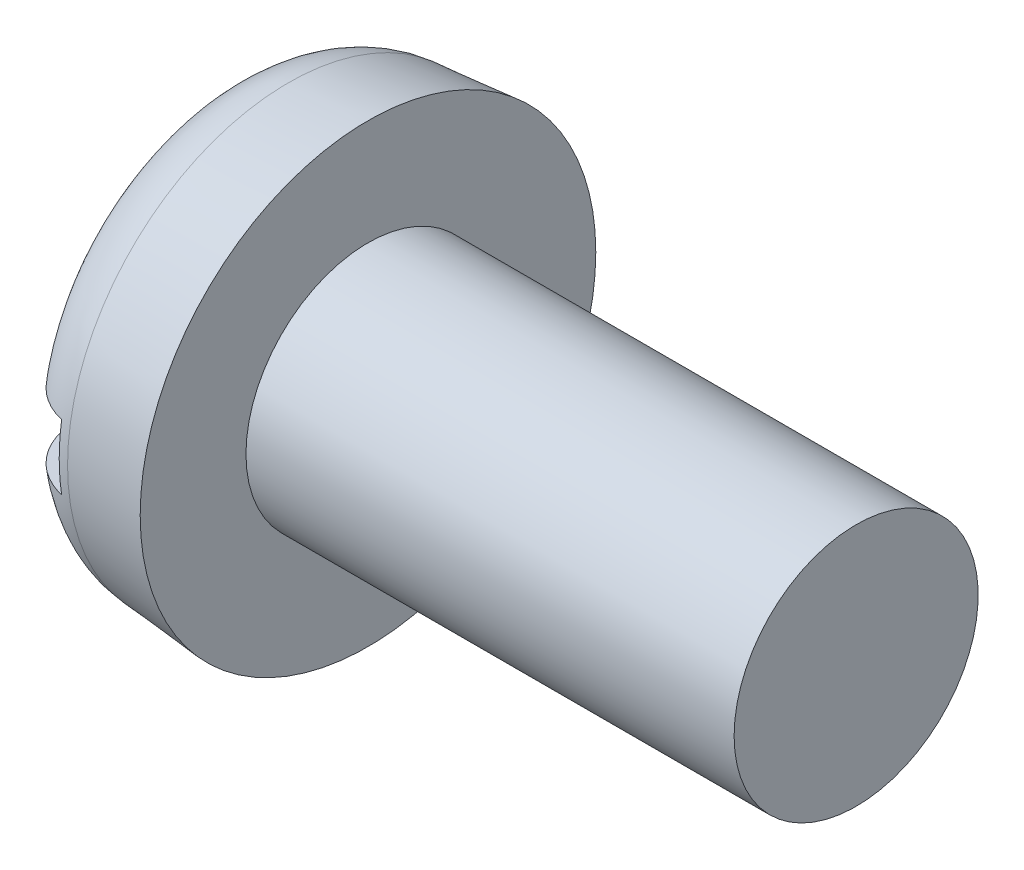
ISO-10303-21;
HEADER;
FILE_DESCRIPTION(('STEP AP214'),'2;1');
FILE_NAME('part.step','',(''),(''),'','','');
FILE_SCHEMA(('AUTOMOTIVE_DESIGN { 1 0 10303 214 1 1 1 1 }'));
ENDSEC;
DATA;
#1=APPLICATION_CONTEXT('core data for automotive mechanical design processes');
#2=APPLICATION_PROTOCOL_DEFINITION('international standard','automotive_design',2000,#1);
#3=PRODUCT_CONTEXT('',#1,'mechanical');
#4=PRODUCT('Part','Part','',(#3));
#5=PRODUCT_RELATED_PRODUCT_CATEGORY('part','',(#4));
#6=PRODUCT_DEFINITION_FORMATION('','',#4);
#7=PRODUCT_DEFINITION_CONTEXT('part definition',#1,'design');
#8=PRODUCT_DEFINITION('design','',#6,#7);
#9=PRODUCT_DEFINITION_SHAPE('','',#8);
#10=(LENGTH_UNIT() NAMED_UNIT(*) SI_UNIT(.MILLI.,.METRE.));
#11=(NAMED_UNIT(*) PLANE_ANGLE_UNIT() SI_UNIT($,.RADIAN.));
#12=(NAMED_UNIT(*) SI_UNIT($,.STERADIAN.) SOLID_ANGLE_UNIT());
#13=UNCERTAINTY_MEASURE_WITH_UNIT(LENGTH_MEASURE(1.E-05),#10,'distance_accuracy_value','');
#14=(GEOMETRIC_REPRESENTATION_CONTEXT(3) GLOBAL_UNCERTAINTY_ASSIGNED_CONTEXT((#13)) GLOBAL_UNIT_ASSIGNED_CONTEXT((#10,
#11,#12)) REPRESENTATION_CONTEXT('',''));
#15=CARTESIAN_POINT('',(0.,0.,0.));
#16=DIRECTION('',(0.,0.,1.));
#17=DIRECTION('',(1.,0.,0.));
#18=AXIS2_PLACEMENT_3D('',#15,#16,#17);
#19=CARTESIAN_POINT('',(0.,0.,0.));
#20=DIRECTION('',(-1.,0.,0.));
#21=DIRECTION('',(0.,0.,1.));
#22=AXIS2_PLACEMENT_3D('',#19,#20,#21);
#23=PLANE('',#22);
#24=DIRECTION('',(0.,0.,-1.));
#25=VECTOR('',#24,1.);
#26=CARTESIAN_POINT('',(0.,0.399999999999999,2.8));
#27=LINE('',#26,#25);
#28=CARTESIAN_POINT('',(0.,0.399999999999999,1.77326763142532));
#29=VERTEX_POINT('',#28);
#30=CARTESIAN_POINT('',(0.,0.399999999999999,-1.77326763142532));
#31=VERTEX_POINT('',#30);
#32=EDGE_CURVE('E85',#29,#31,#27,.T.);
#33=ORIENTED_EDGE('',*,*,#32,.F.);
#34=CARTESIAN_POINT('',(0.,0.,0.));
#35=DIRECTION('',(-1.,0.,0.));
#36=DIRECTION('',(0.,0.,1.));
#37=AXIS2_PLACEMENT_3D('',#34,#35,#36);
#38=CIRCLE('',#37,1.81782234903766);
#39=EDGE_CURVE('E91',#29,#31,#38,.T.);
#40=ORIENTED_EDGE('',*,*,#39,.T.);
#41=EDGE_LOOP('',(#33,#40));
#42=FACE_BOUND('',#41,.T.);
#43=ADVANCED_FACE('F32',(#42),#23,.T.);
#44=CARTESIAN_POINT('',(-25.4,0.,0.));
#45=DIRECTION('',(-1.,0.,0.));
#46=DIRECTION('',(0.,0.,1.));
#47=AXIS2_PLACEMENT_3D('',#44,#45,#46);
#48=CYLINDRICAL_SURFACE('',#47,1.5);
#49=CARTESIAN_POINT('',(7.8,0.,0.));
#50=DIRECTION('',(-1.,0.,0.));
#51=DIRECTION('',(0.,0.,1.));
#52=AXIS2_PLACEMENT_3D('',#49,#50,#51);
#53=CIRCLE('',#52,1.5);
#54=CARTESIAN_POINT('',(7.8,0.,1.5));
#55=VERTEX_POINT('',#54);
#56=EDGE_CURVE('E92',#55,#55,#53,.T.);
#57=ORIENTED_EDGE('',*,*,#56,.T.);
#58=EDGE_LOOP('',(#57));
#59=FACE_BOUND('',#58,.T.);
#60=CARTESIAN_POINT('',(1.8,0.,0.));
#61=DIRECTION('',(-1.,0.,0.));
#62=DIRECTION('',(0.,0.,1.));
#63=AXIS2_PLACEMENT_3D('',#60,#61,#62);
#64=CIRCLE('',#63,1.5);
#65=CARTESIAN_POINT('',(1.8,0.,1.5));
#66=VERTEX_POINT('',#65);
#67=EDGE_CURVE('E149',#66,#66,#64,.T.);
#68=ORIENTED_EDGE('',*,*,#67,.F.);
#69=EDGE_LOOP('',(#68));
#70=FACE_BOUND('',#69,.T.);
#71=ADVANCED_FACE('F137',(#59,#70),#48,.T.);
#72=CARTESIAN_POINT('',(7.8,1.5,0.));
#73=DIRECTION('',(1.,0.,0.));
#74=DIRECTION('',(0.,0.,-1.));
#75=AXIS2_PLACEMENT_3D('',#72,#73,#74);
#76=PLANE('',#75);
#77=ORIENTED_EDGE('',*,*,#56,.F.);
#78=EDGE_LOOP('',(#77));
#79=FACE_BOUND('',#78,.T.);
#80=ADVANCED_FACE('F135',(#79),#76,.T.);
#81=DIRECTION('',(0.,0.,1.));
#82=VECTOR('',#81,1.);
#83=CARTESIAN_POINT('',(0.,-0.4,-2.8));
#84=LINE('',#83,#82);
#85=CARTESIAN_POINT('',(0.,-0.4,-1.77326763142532));
#86=VERTEX_POINT('',#85);
#87=CARTESIAN_POINT('',(0.,-0.4,1.77326763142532));
#88=VERTEX_POINT('',#87);
#89=EDGE_CURVE('E76',#86,#88,#84,.T.);
#90=ORIENTED_EDGE('',*,*,#89,.F.);
#91=EDGE_CURVE('E83',#86,#88,#38,.T.);
#92=ORIENTED_EDGE('',*,*,#91,.T.);
#93=EDGE_LOOP('',(#90,#92));
#94=FACE_BOUND('',#93,.T.);
#95=ADVANCED_FACE('F82',(#94),#23,.T.);
#96=CARTESIAN_POINT('',(0.,0.,0.));
#97=DIRECTION('',(1.,0.,0.));
#98=DIRECTION('',(0.,0.,-1.));
#99=AXIS2_PLACEMENT_3D('',#96,#97,#98);
#100=CONICAL_SURFACE('',#99,2.64252040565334,0.087266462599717);
#101=CARTESIAN_POINT('',(0.821559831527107,0.,0.));
#102=DIRECTION('',(-1.,0.,0.));
#103=DIRECTION('',(0.,0.,1.));
#104=AXIS2_PLACEMENT_3D('',#101,#102,#103);
#105=CIRCLE('',#104,2.71439757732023);
#106=CARTESIAN_POINT('',(0.821559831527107,0.,2.71439757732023));
#107=VERTEX_POINT('',#106);
#108=EDGE_CURVE('E95',#107,#107,#105,.F.);
#109=ORIENTED_EDGE('',*,*,#108,.T.);
#110=EDGE_LOOP('',(#109));
#111=FACE_BOUND('',#110,.T.);
#112=CARTESIAN_POINT('',(1.8,0.,0.));
#113=DIRECTION('',(-1.,0.,0.));
#114=DIRECTION('',(0.,0.,1.));
#115=AXIS2_PLACEMENT_3D('',#112,#113,#114);
#116=CIRCLE('',#115,2.8);
#117=CARTESIAN_POINT('',(1.8,0.,2.8));
#118=VERTEX_POINT('',#117);
#119=EDGE_CURVE('E97',#118,#118,#116,.T.);
#120=ORIENTED_EDGE('',*,*,#119,.T.);
#121=EDGE_LOOP('',(#120));
#122=FACE_BOUND('',#121,.T.);
#123=ADVANCED_FACE('F128',(#111,#122),#100,.T.);
#124=CARTESIAN_POINT('',(1.8,1.5,0.));
#125=DIRECTION('',(-1.,0.,0.));
#126=DIRECTION('',(0.,0.,1.));
#127=AXIS2_PLACEMENT_3D('',#124,#125,#126);
#128=PLANE('',#127);
#129=ORIENTED_EDGE('',*,*,#119,.F.);
#130=EDGE_LOOP('',(#129));
#131=FACE_BOUND('',#130,.T.);
#132=ORIENTED_EDGE('',*,*,#67,.T.);
#133=EDGE_LOOP('',(#132));
#134=FACE_BOUND('',#133,.T.);
#135=ADVANCED_FACE('F124',(#131,#134),#128,.F.);
#136=CARTESIAN_POINT('',(0.9,0.,0.));
#137=DIRECTION('',(-1.,0.,0.));
#138=DIRECTION('',(0.,0.,1.));
#139=AXIS2_PLACEMENT_3D('',#136,#137,#138);
#140=TOROIDAL_SURFACE('',#139,1.81782234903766,0.9);
#141=CARTESIAN_POINT('',(0.285780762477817,0.399999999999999,-2.44311963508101));
#142=CARTESIAN_POINT('',(0.322325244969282,0.399999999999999,-2.47769297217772));
#143=CARTESIAN_POINT('',(0.361794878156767,0.399999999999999,-2.50922544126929));
#144=CARTESIAN_POINT('',(0.445493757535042,0.399999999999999,-2.56525291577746));
#145=CARTESIAN_POINT('',(0.48972822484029,0.399999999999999,-2.58974009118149));
#146=CARTESIAN_POINT('',(0.581685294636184,0.399999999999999,-2.63091846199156));
#147=CARTESIAN_POINT('',(0.629407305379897,0.399999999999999,-2.64761097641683));
#148=CARTESIAN_POINT('',(0.726972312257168,0.399999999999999,-2.67270033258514));
#149=CARTESIAN_POINT('',(0.776814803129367,0.399999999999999,-2.68109913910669));
#150=CARTESIAN_POINT('',(0.876977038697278,0.399999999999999,-2.68933922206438));
#151=CARTESIAN_POINT('',(0.92729364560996,0.399999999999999,-2.68921866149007));
#152=CARTESIAN_POINT('',(1.02719093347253,0.399999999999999,-2.68051830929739));
#153=CARTESIAN_POINT('',(1.07677160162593,0.399999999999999,-2.67193837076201));
#154=CARTESIAN_POINT('',(1.17371760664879,0.399999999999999,-2.6465919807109));
#155=CARTESIAN_POINT('',(1.2210859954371,0.399999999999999,-2.62983719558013));
#156=CARTESIAN_POINT('',(1.31235127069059,0.399999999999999,-2.58864040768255));
#157=CARTESIAN_POINT('',(1.35624813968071,0.399999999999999,-2.56419836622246));
#158=CARTESIAN_POINT('',(1.43950339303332,0.399999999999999,-2.50824069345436));
#159=CARTESIAN_POINT('',(1.47884484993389,0.399999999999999,-2.47669988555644));
#160=CARTESIAN_POINT('',(1.55173067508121,0.399999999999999,-2.40751412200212));
#161=CARTESIAN_POINT('',(1.5852748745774,0.399999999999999,-2.36986898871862));
#162=CARTESIAN_POINT('',(1.64594872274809,0.399999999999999,-2.28919528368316));
#163=CARTESIAN_POINT('',(1.67301846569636,0.399999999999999,-2.24612167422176));
#164=CARTESIAN_POINT('',(1.71966197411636,0.399999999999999,-2.15609376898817));
#165=CARTESIAN_POINT('',(1.73923530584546,0.399999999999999,-2.10913924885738));
#166=CARTESIAN_POINT('',(1.77066025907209,0.399999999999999,-2.01194193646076));
#167=CARTESIAN_POINT('',(1.78239254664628,0.399999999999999,-1.96166058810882));
#168=CARTESIAN_POINT('',(1.7974373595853,0.399999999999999,-1.85985639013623));
#169=CARTESIAN_POINT('',(1.80074908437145,0.399999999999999,-1.80833342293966));
#170=CARTESIAN_POINT('',(1.79894832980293,0.399999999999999,-1.70434405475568));
#171=CARTESIAN_POINT('',(1.79365584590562,0.399999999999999,-1.651880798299));
#172=CARTESIAN_POINT('',(1.77456092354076,0.399999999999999,-1.54852841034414));
#173=CARTESIAN_POINT('',(1.76075741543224,0.399999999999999,-1.49763947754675));
#174=CARTESIAN_POINT('',(1.7246504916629,0.399999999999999,-1.3975266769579));
#175=CARTESIAN_POINT('',(1.70214283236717,0.399999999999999,-1.34837644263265));
#176=CARTESIAN_POINT('',(1.64933120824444,0.399999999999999,-1.25444995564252));
#177=CARTESIAN_POINT('',(1.6190255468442,0.399999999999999,-1.20967465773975));
#178=CARTESIAN_POINT('',(1.55085214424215,0.399999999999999,-1.12504927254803));
#179=CARTESIAN_POINT('',(1.51286662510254,0.399999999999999,-1.08529386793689));
#180=CARTESIAN_POINT('',(1.4306134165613,0.399999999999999,-1.01288372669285));
#181=CARTESIAN_POINT('',(1.38634513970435,0.399999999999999,-0.980229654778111));
#182=CARTESIAN_POINT('',(1.29378824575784,0.399999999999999,-0.924048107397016));
#183=CARTESIAN_POINT('',(1.24562231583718,0.399999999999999,-0.900319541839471));
#184=CARTESIAN_POINT('',(1.14574424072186,0.399999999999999,-0.862177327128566));
#185=CARTESIAN_POINT('',(1.09403573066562,0.399999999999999,-0.847754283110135));
#186=CARTESIAN_POINT('',(0.993395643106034,0.399999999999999,-0.830011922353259));
#187=CARTESIAN_POINT('',(0.944615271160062,0.399999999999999,-0.825833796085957));
#188=CARTESIAN_POINT('',(0.847107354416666,0.399999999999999,-0.826334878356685));
#189=CARTESIAN_POINT('',(0.798379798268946,0.399999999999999,-0.831011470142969));
#190=CARTESIAN_POINT('',(0.705495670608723,0.399999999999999,-0.848340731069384));
#191=CARTESIAN_POINT('',(0.661242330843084,0.399999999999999,-0.860484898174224));
#192=CARTESIAN_POINT('',(0.575232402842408,0.399999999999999,-0.891650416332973));
#193=CARTESIAN_POINT('',(0.53347652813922,0.399999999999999,-0.910673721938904));
#194=CARTESIAN_POINT('',(0.451191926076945,0.399999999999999,-0.956010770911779));
#195=CARTESIAN_POINT('',(0.410848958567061,0.399999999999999,-0.982660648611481));
#196=CARTESIAN_POINT('',(0.334722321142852,0.399999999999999,-1.04182188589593));
#197=CARTESIAN_POINT('',(0.298940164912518,0.399999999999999,-1.0743351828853));
#198=CARTESIAN_POINT('',(0.229649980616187,0.399999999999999,-1.14749226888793));
#199=CARTESIAN_POINT('',(0.19663491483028,0.399999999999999,-1.18860403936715));
#200=CARTESIAN_POINT('',(0.137645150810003,0.399999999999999,-1.27560624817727));
#201=CARTESIAN_POINT('',(0.111672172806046,0.399999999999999,-1.32149785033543));
#202=CARTESIAN_POINT('',(0.0665593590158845,0.399999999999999,-1.41881690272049));
#203=CARTESIAN_POINT('',(0.0477401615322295,0.399999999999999,-1.47039354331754));
#204=CARTESIAN_POINT('',(0.0191028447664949,0.399999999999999,-1.57598967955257));
#205=CARTESIAN_POINT('',(0.0092842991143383,0.399999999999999,-1.63000905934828));
#206=CARTESIAN_POINT('',(-0.000908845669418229,0.399999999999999,-1.73850050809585));
#207=CARTESIAN_POINT('',(-0.00135843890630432,0.399999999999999,-1.7929654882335));
#208=CARTESIAN_POINT('',(0.00713794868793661,0.399999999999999,-1.90117587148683));
#209=CARTESIAN_POINT('',(0.0160852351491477,0.399999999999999,-1.9549211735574));
#210=CARTESIAN_POINT('',(0.0428869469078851,0.399999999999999,-2.05874477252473));
#211=CARTESIAN_POINT('',(0.0605196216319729,0.399999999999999,-2.10888044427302));
#212=CARTESIAN_POINT('',(0.104140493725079,0.399999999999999,-2.20532358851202));
#213=CARTESIAN_POINT('',(0.130117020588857,0.399999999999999,-2.25163629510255));
#214=CARTESIAN_POINT('',(0.178150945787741,0.399999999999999,-2.32211375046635));
#215=CARTESIAN_POINT('',(0.197843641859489,0.399999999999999,-2.34792122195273));
#216=CARTESIAN_POINT('',(0.239879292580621,0.399999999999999,-2.39728022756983));
#217=CARTESIAN_POINT('',(0.26222221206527,0.399999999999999,-2.42083179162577));
#218=CARTESIAN_POINT('',(0.285780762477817,0.399999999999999,-2.44311963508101));
#219=B_SPLINE_CURVE_WITH_KNOTS('',3,(#141,#142,#143,#144,#145,#146,#147,#148,#149,#150,#151,
#152,#153,#154,#155,#156,#157,#158,#159,#160,#161,#162,#163,#164,#165,#166,#167,#168,#169,#170,
#171,#172,#173,#174,#175,#176,#177,#178,#179,#180,#181,#182,#183,#184,#185,#186,#187,#188,#189,
#190,#191,#192,#193,#194,#195,#196,#197,#198,#199,#200,#201,#202,#203,#204,#205,#206,#207,#208,
#209,#210,#211,#212,#213,#214,#215,#216,#217,#218),.UNSPECIFIED.,.T.,.F.,(4,2,2,2,2,2,2,2,2,2,2,
2,2,2,2,2,2,2,2,2,2,2,2,2,2,2,2,2,2,2,2,2,2,2,2,2,2,2,4),(0.,0.15080428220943,0.301775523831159,
0.452721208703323,0.603631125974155,0.753865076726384,0.904101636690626,1.05412441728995,
1.2041479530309,1.35471219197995,1.50528081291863,1.65719291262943,1.80911380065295,
1.96329712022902,2.11749509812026,2.27496068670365,2.43244606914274,2.59387611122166,
2.75534130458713,2.9195015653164,3.08367718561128,3.24389389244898,3.40394859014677,
3.55004213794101,3.69609251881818,3.83315592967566,3.97025831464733,4.11470991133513,
4.25920932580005,4.41668805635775,4.57420522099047,4.73812462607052,4.90203626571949,
5.06463536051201,5.22725705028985,5.38592661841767,5.54437521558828,5.64159310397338,
5.73880970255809),.UNSPECIFIED.);
#220=CARTESIAN_POINT('',(0.7,0.399999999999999,-2.66547244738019));
#221=VERTEX_POINT('',#220);
#222=EDGE_CURVE('E11',#31,#221,#219,.T.);
#223=ORIENTED_EDGE('',*,*,#222,.F.);
#224=ORIENTED_EDGE('',*,*,#39,.F.);
#225=CARTESIAN_POINT('',(0.356169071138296,0.399999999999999,1.02545886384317));
#226=CARTESIAN_POINT('',(0.394477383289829,0.399999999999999,0.994276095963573));
#227=CARTESIAN_POINT('',(0.435252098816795,0.399999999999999,0.966090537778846));
#228=CARTESIAN_POINT('',(0.520874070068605,0.399999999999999,0.916713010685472));
#229=CARTESIAN_POINT('',(0.56572297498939,0.399999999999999,0.895523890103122));
#230=CARTESIAN_POINT('',(0.658585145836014,0.399999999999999,0.861072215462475));
#231=CARTESIAN_POINT('',(0.706609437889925,0.399999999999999,0.84783908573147));
#232=CARTESIAN_POINT('',(0.80424325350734,0.399999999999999,0.83024223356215));
#233=CARTESIAN_POINT('',(0.853851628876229,0.399999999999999,0.825872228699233));
#234=CARTESIAN_POINT('',(0.950010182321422,0.399999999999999,0.826277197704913));
#235=CARTESIAN_POINT('',(0.99656347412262,0.399999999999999,0.830513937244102));
#236=CARTESIAN_POINT('',(1.08828168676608,0.399999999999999,0.846797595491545));
#237=CARTESIAN_POINT('',(1.1334463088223,0.399999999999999,0.858846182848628));
#238=CARTESIAN_POINT('',(1.22099947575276,0.399999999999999,0.890027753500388));
#239=CARTESIAN_POINT('',(1.26339999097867,0.399999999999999,0.909127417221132));
#240=CARTESIAN_POINT('',(1.34475562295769,0.399999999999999,0.953613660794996));
#241=CARTESIAN_POINT('',(1.38370973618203,0.399999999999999,0.979002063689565));
#242=CARTESIAN_POINT('',(1.4606297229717,0.399999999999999,1.03768873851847));
#243=CARTESIAN_POINT('',(1.49821861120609,0.399999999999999,1.07148126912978));
#244=CARTESIAN_POINT('',(1.56766557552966,0.399999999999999,1.14451739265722));
#245=CARTESIAN_POINT('',(1.59952174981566,0.399999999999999,1.18376278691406));
#246=CARTESIAN_POINT('',(1.65882951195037,0.399999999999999,1.26965174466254));
#247=CARTESIAN_POINT('',(1.68580874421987,0.399999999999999,1.3166225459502));
#248=CARTESIAN_POINT('',(1.7316261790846,0.399999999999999,1.41438438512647));
#249=CARTESIAN_POINT('',(1.7504634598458,0.399999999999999,1.46517585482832));
#250=CARTESIAN_POINT('',(1.77959171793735,0.399999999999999,1.56990546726));
#251=CARTESIAN_POINT('',(1.78976336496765,0.399999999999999,1.62387693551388));
#252=CARTESIAN_POINT('',(1.80070617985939,0.399999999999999,1.73276786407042));
#253=CARTESIAN_POINT('',(1.80147810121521,0.399999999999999,1.78768724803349));
#254=CARTESIAN_POINT('',(1.7935515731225,0.399999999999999,1.89576039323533));
#255=CARTESIAN_POINT('',(1.78503812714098,0.399999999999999,1.94892767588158));
#256=CARTESIAN_POINT('',(1.75897009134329,0.399999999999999,2.05299963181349));
#257=CARTESIAN_POINT('',(1.74141670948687,0.399999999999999,2.10390460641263));
#258=CARTESIAN_POINT('',(1.69825810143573,0.399999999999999,2.20064023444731));
#259=CARTESIAN_POINT('',(1.67286703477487,0.399999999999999,2.24656646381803));
#260=CARTESIAN_POINT('',(1.61458416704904,0.399999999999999,2.33338474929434));
#261=CARTESIAN_POINT('',(1.58169323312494,0.399999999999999,2.37427738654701));
#262=CARTESIAN_POINT('',(1.51007060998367,0.399999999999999,2.44900649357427));
#263=CARTESIAN_POINT('',(1.47146964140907,0.399999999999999,2.48296829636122));
#264=CARTESIAN_POINT('',(1.38904817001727,0.399999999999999,2.54382334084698));
#265=CARTESIAN_POINT('',(1.34522808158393,0.399999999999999,2.57071714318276));
#266=CARTESIAN_POINT('',(1.25424836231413,0.399999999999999,2.61630908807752));
#267=CARTESIAN_POINT('',(1.20714119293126,0.399999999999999,2.63511196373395));
#268=CARTESIAN_POINT('',(1.11042474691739,0.399999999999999,2.66447616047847));
#269=CARTESIAN_POINT('',(1.06081558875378,0.399999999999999,2.67503787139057));
#270=CARTESIAN_POINT('',(0.960893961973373,0.399999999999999,2.68755622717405));
#271=CARTESIAN_POINT('',(0.910589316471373,0.399999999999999,2.68957539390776));
#272=CARTESIAN_POINT('',(0.810358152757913,0.399999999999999,2.68512046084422));
#273=CARTESIAN_POINT('',(0.760431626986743,0.399999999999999,2.67864653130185));
#274=CARTESIAN_POINT('',(0.662478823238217,0.399999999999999,2.65741995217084));
#275=CARTESIAN_POINT('',(0.614448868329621,0.399999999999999,2.64268425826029));
#276=CARTESIAN_POINT('',(0.521534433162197,0.399999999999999,2.60538142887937));
#277=CARTESIAN_POINT('',(0.476649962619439,0.399999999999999,2.58281426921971));
#278=CARTESIAN_POINT('',(0.391148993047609,0.399999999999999,2.53043182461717));
#279=CARTESIAN_POINT('',(0.350545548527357,0.399999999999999,2.50059523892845));
#280=CARTESIAN_POINT('',(0.274874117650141,0.399999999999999,2.43457977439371));
#281=CARTESIAN_POINT('',(0.239806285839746,0.399999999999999,2.39840071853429));
#282=CARTESIAN_POINT('',(0.1758792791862,0.399999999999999,2.32042102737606));
#283=CARTESIAN_POINT('',(0.147073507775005,0.399999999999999,2.27857662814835));
#284=CARTESIAN_POINT('',(0.0967847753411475,0.399999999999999,2.19069995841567));
#285=CARTESIAN_POINT('',(0.07530224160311,0.399999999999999,2.14466744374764));
#286=CARTESIAN_POINT('',(0.0399276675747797,0.399999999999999,2.04903409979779));
#287=CARTESIAN_POINT('',(0.0261471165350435,0.399999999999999,1.99939205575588));
#288=CARTESIAN_POINT('',(0.00693602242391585,0.399999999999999,1.89852251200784));
#289=CARTESIAN_POINT('',(0.00150590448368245,0.399999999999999,1.84729493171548));
#290=CARTESIAN_POINT('',(-0.000985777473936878,0.399999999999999,1.74359522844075));
#291=CARTESIAN_POINT('',(0.0021251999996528,0.399999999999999,1.69111899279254));
#292=CARTESIAN_POINT('',(0.0168916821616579,0.399999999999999,1.58737297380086));
#293=CARTESIAN_POINT('',(0.0285499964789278,0.399999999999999,1.53610359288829));
#294=CARTESIAN_POINT('',(0.0604020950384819,0.399999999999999,1.43486374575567));
#295=CARTESIAN_POINT('',(0.080804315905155,0.399999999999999,1.38495893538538));
#296=CARTESIAN_POINT('',(0.129530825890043,0.399999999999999,1.28921347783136));
#297=CARTESIAN_POINT('',(0.157849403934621,0.399999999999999,1.24336993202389));
#298=CARTESIAN_POINT('',(0.213684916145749,0.399999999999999,1.16773658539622));
#299=CARTESIAN_POINT('',(0.239651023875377,0.399999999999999,1.13678903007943));
#300=CARTESIAN_POINT('',(0.29525297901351,0.399999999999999,1.07838116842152));
#301=CARTESIAN_POINT('',(0.324888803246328,0.399999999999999,1.05092084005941));
#302=CARTESIAN_POINT('',(0.356169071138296,0.399999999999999,1.02545886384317));
#303=B_SPLINE_CURVE_WITH_KNOTS('',3,(#225,#226,#227,#228,#229,#230,#231,#232,#233,#234,#235,
#236,#237,#238,#239,#240,#241,#242,#243,#244,#245,#246,#247,#248,#249,#250,#251,#252,#253,#254,
#255,#256,#257,#258,#259,#260,#261,#262,#263,#264,#265,#266,#267,#268,#269,#270,#271,#272,#273,
#274,#275,#276,#277,#278,#279,#280,#281,#282,#283,#284,#285,#286,#287,#288,#289,#290,#291,#292,
#293,#294,#295,#296,#297,#298,#299,#300,#301,#302),.UNSPECIFIED.,.T.,.F.,(4,2,2,2,2,2,2,2,2,2,2,
2,2,2,2,2,2,2,2,2,2,2,2,2,2,2,2,2,2,2,2,2,2,2,2,2,2,2,4),(0.,0.148056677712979,
0.296173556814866,0.444834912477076,0.593390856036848,0.732942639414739,0.87252424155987,
1.01145452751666,1.15042513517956,1.30141738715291,1.45245963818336,1.61420969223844,
1.7759780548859,1.93993961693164,2.10388803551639,2.26462860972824,2.42534771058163,
2.58201478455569,2.73866375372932,2.89216335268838,3.04565077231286,3.19708679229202,
3.34851564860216,3.49883427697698,3.64914989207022,3.79915813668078,3.94916684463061,
4.09962050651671,4.25007836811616,4.40177296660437,4.55347641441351,4.70732244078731,
4.86117629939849,5.0181609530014,5.17519723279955,5.33620557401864,5.49709805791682,
5.61799301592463,5.73888721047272),.UNSPECIFIED.);
#304=CARTESIAN_POINT('',(0.7,0.399999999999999,2.66547244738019));
#305=VERTEX_POINT('',#304);
#306=EDGE_CURVE('E109',#305,#29,#303,.T.);
#307=ORIENTED_EDGE('',*,*,#306,.F.);
#308=CARTESIAN_POINT('',(0.7,0.,0.));
#309=DIRECTION('',(-1.,0.,0.));
#310=DIRECTION('',(0.,0.,1.));
#311=AXIS2_PLACEMENT_3D('',#308,#309,#310);
#312=CIRCLE('',#311,2.69531878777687);
#313=CARTESIAN_POINT('',(0.7,-0.4,2.66547244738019));
#314=VERTEX_POINT('',#313);
#315=EDGE_CURVE('E103',#305,#314,#312,.F.);
#316=ORIENTED_EDGE('',*,*,#315,.T.);
#317=CARTESIAN_POINT('',(0.356169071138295,-0.4,1.02545886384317));
#318=CARTESIAN_POINT('',(0.314031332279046,-0.4,1.05976167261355));
#319=CARTESIAN_POINT('',(0.274819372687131,-0.4,1.0977427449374));
#320=CARTESIAN_POINT('',(0.20326819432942,-0.4,1.17978565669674));
#321=CARTESIAN_POINT('',(0.170942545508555,-0.4,1.22385922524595));
#322=CARTESIAN_POINT('',(0.114111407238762,-0.4,1.31672727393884));
#323=CARTESIAN_POINT('',(0.0895968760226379,-0.4,1.36551620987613));
#324=CARTESIAN_POINT('',(0.0490785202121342,-0.4,1.46648183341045));
#325=CARTESIAN_POINT('',(0.0330703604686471,-0.4,1.51865678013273));
#326=CARTESIAN_POINT('',(0.0100453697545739,-0.4,1.62518908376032));
#327=CARTESIAN_POINT('',(0.00306618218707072,-0.4,1.67955460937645));
#328=CARTESIAN_POINT('',(-0.00144685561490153,-0.4,1.78868546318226));
#329=CARTESIAN_POINT('',(0.00101939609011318,-0.4,1.84345079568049));
#330=CARTESIAN_POINT('',(0.0152891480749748,-0.4,1.95052330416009));
#331=CARTESIAN_POINT('',(0.0268854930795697,-0.4,2.0028580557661));
#332=CARTESIAN_POINT('',(0.0589248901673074,-0.4,2.10474672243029));
#333=CARTESIAN_POINT('',(0.0793666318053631,-0.4,2.15430104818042));
#334=CARTESIAN_POINT('',(0.12795627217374,-0.4,2.24792186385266));
#335=CARTESIAN_POINT('',(0.155901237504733,-0.4,2.29209371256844));
#336=CARTESIAN_POINT('',(0.218944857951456,-0.4,2.37499861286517));
#337=CARTESIAN_POINT('',(0.254042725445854,-0.4,2.41373226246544));
#338=CARTESIAN_POINT('',(0.32966685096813,-0.4,2.48389534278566));
#339=CARTESIAN_POINT('',(0.370077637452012,-0.4,2.51544927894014));
#340=CARTESIAN_POINT('',(0.455677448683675,-0.4,2.57122459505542));
#341=CARTESIAN_POINT('',(0.500866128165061,-0.4,2.59544650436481));
#342=CARTESIAN_POINT('',(0.59413782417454,-0.4,2.6355729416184));
#343=CARTESIAN_POINT('',(0.642178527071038,-0.4,2.65157587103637));
#344=CARTESIAN_POINT('',(0.740273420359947,-0.4,2.67523109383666));
#345=CARTESIAN_POINT('',(0.790327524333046,-0.4,2.68288374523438));
#346=CARTESIAN_POINT('',(0.890686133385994,-0.4,2.68958762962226));
#347=CARTESIAN_POINT('',(0.940986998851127,-0.4,2.68869347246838));
#348=CARTESIAN_POINT('',(1.04072178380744,-0.4,2.67846167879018));
#349=CARTESIAN_POINT('',(1.0901557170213,-0.4,2.66912417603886));
#350=CARTESIAN_POINT('',(1.18669599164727,-0.4,2.64229877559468));
#351=CARTESIAN_POINT('',(1.23380501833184,-0.4,2.6248205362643));
#352=CARTESIAN_POINT('',(1.32443528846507,-0.4,2.58223220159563));
#353=CARTESIAN_POINT('',(1.36795650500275,-0.4,2.5571220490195));
#354=CARTESIAN_POINT('',(1.45036421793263,-0.4,2.49989362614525));
#355=CARTESIAN_POINT('',(1.48923230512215,-0.4,2.46774885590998));
#356=CARTESIAN_POINT('',(1.56107927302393,-0.4,2.39744378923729));
#357=CARTESIAN_POINT('',(1.59405796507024,-0.4,2.35928330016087));
#358=CARTESIAN_POINT('',(1.65352847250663,-0.4,2.2776666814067));
#359=CARTESIAN_POINT('',(1.67995797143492,-0.4,2.23416516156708));
#360=CARTESIAN_POINT('',(1.72526137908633,-0.4,2.14339421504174));
#361=CARTESIAN_POINT('',(1.74413484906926,-0.4,2.09612456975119));
#362=CARTESIAN_POINT('',(1.77411508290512,-0.4,1.9983989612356));
#363=CARTESIAN_POINT('',(1.78509960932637,-0.4,1.9479055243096));
#364=CARTESIAN_POINT('',(1.79862667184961,-0.4,1.84580292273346));
#365=CARTESIAN_POINT('',(1.80116838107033,-0.4,1.79419364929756));
#366=CARTESIAN_POINT('',(1.79780993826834,-0.4,1.69014314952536));
#367=CARTESIAN_POINT('',(1.79172746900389,-0.4,1.63770783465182));
#368=CARTESIAN_POINT('',(1.77106806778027,-0.4,1.53454005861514));
#369=CARTESIAN_POINT('',(1.75649007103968,-0.4,1.48380781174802));
#370=CARTESIAN_POINT('',(1.7188487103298,-0.4,1.38413781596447));
#371=CARTESIAN_POINT('',(1.69558194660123,-0.4,1.33527684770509));
#372=CARTESIAN_POINT('',(1.64130257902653,-0.4,1.24205401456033));
#373=CARTESIAN_POINT('',(1.6102882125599,-0.4,1.19769317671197));
#374=CARTESIAN_POINT('',(1.54078360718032,-0.4,1.11407031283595));
#375=CARTESIAN_POINT('',(1.50218355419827,-0.4,1.07489936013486));
#376=CARTESIAN_POINT('',(1.418793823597,-0.4,1.00377929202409));
#377=CARTESIAN_POINT('',(1.37400377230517,-0.4,0.971830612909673));
#378=CARTESIAN_POINT('',(1.28066227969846,-0.4,0.917245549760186));
#379=CARTESIAN_POINT('',(1.23224470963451,-0.4,0.894381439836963));
#380=CARTESIAN_POINT('',(1.13202516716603,-0.4,0.858023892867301));
#381=CARTESIAN_POINT('',(1.08022692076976,-0.4,0.844520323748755));
#382=CARTESIAN_POINT('',(0.979686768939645,-0.4,0.828554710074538));
#383=CARTESIAN_POINT('',(0.93108358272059,-0.4,0.82521631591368));
#384=CARTESIAN_POINT('',(0.834057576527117,-0.4,0.827306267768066));
#385=CARTESIAN_POINT('',(0.785634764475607,-0.4,0.832734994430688));
#386=CARTESIAN_POINT('',(0.693219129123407,-0.4,0.851440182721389));
#387=CARTESIAN_POINT('',(0.6491307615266,-0.4,0.864254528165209));
#388=CARTESIAN_POINT('',(0.563580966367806,-0.4,0.896690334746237));
#389=CARTESIAN_POINT('',(0.522117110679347,-0.4,0.916305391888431));
#390=CARTESIAN_POINT('',(0.460201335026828,-0.4,0.951554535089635));
#391=CARTESIAN_POINT('',(0.438547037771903,-0.4,0.965129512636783));
#392=CARTESIAN_POINT('',(0.396436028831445,-0.4,0.994018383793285));
#393=CARTESIAN_POINT('',(0.375979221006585,-0.4,1.00933213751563));
#394=CARTESIAN_POINT('',(0.356169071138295,-0.4,1.02545886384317));
#395=B_SPLINE_CURVE_WITH_KNOTS('',3,(#317,#318,#319,#320,#321,#322,#323,#324,#325,#326,#327,
#328,#329,#330,#331,#332,#333,#334,#335,#336,#337,#338,#339,#340,#341,#342,#343,#344,#345,#346,
#347,#348,#349,#350,#351,#352,#353,#354,#355,#356,#357,#358,#359,#360,#361,#362,#363,#364,#365,
#366,#367,#368,#369,#370,#371,#372,#373,#374,#375,#376,#377,#378,#379,#380,#381,#382,#383,#384,
#385,#386,#387,#388,#389,#390,#391,#392,#393,#394),.UNSPECIFIED.,.T.,.F.,(4,2,2,2,2,2,2,2,2,2,2,
2,2,2,2,2,2,2,2,2,2,2,2,2,2,2,2,2,2,2,2,2,2,2,2,2,2,2,4),(0.,0.162908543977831,
0.326135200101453,0.489172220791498,0.652126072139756,0.815757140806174,0.979389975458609,
1.13941349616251,1.29941331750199,1.45545894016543,1.61148738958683,1.76455910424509,
1.91761976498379,2.068802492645,2.21997873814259,2.37018969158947,2.52039826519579,
2.67042907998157,2.82046101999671,2.97106818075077,3.12168016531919,3.27367450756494,
3.42567767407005,3.5799880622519,3.73431356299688,3.89195060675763,4.04960741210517,
4.2112132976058,4.37285598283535,4.53703863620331,4.70123120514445,4.86099956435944,
5.02059471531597,5.16597452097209,5.31136063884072,5.44850857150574,5.58552770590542,
5.66212180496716,5.73870974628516),.UNSPECIFIED.);
#396=EDGE_CURVE('E90',#88,#314,#395,.T.);
#397=ORIENTED_EDGE('',*,*,#396,.F.);
#398=ORIENTED_EDGE('',*,*,#91,.F.);
#399=CARTESIAN_POINT('',(0.285780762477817,-0.4,-2.44311963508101));
#400=CARTESIAN_POINT('',(0.248557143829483,-0.4,-2.4078972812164));
#401=CARTESIAN_POINT('',(0.214312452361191,-0.4,-2.3694650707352));
#402=CARTESIAN_POINT('',(0.152768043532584,-0.4,-2.28733938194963));
#403=CARTESIAN_POINT('',(0.125478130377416,-0.4,-2.24363860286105));
#404=CARTESIAN_POINT('',(0.0786257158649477,-0.4,-2.15234079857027));
#405=CARTESIAN_POINT('',(0.0590537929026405,-0.4,-2.10474861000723));
#406=CARTESIAN_POINT('',(0.0280650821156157,-0.4,-2.00700047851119));
#407=CARTESIAN_POINT('',(0.0166461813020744,-0.4,-1.95684520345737));
#408=CARTESIAN_POINT('',(0.00206923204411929,-0.4,-1.85464080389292));
#409=CARTESIAN_POINT('',(-0.000972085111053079,-0.4,-1.80257506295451));
#410=CARTESIAN_POINT('',(0.00151453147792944,-0.4,-1.69864852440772));
#411=CARTESIAN_POINT('',(0.00704382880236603,-0.4,-1.64678776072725));
#412=CARTESIAN_POINT('',(0.0266516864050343,-0.4,-1.5434240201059));
#413=CARTESIAN_POINT('',(0.0409314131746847,-0.4,-1.49195921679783));
#414=CARTESIAN_POINT('',(0.0777275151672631,-0.4,-1.39206285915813));
#415=CARTESIAN_POINT('',(0.100245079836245,-0.4,-1.34363174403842));
#416=CARTESIAN_POINT('',(0.153482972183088,-0.4,-1.2500005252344));
#417=CARTESIAN_POINT('',(0.184382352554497,-0.4,-1.20490211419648));
#418=CARTESIAN_POINT('',(0.253306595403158,-0.4,-1.12049761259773));
#419=CARTESIAN_POINT('',(0.29133345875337,-0.4,-1.08119315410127));
#420=CARTESIAN_POINT('',(0.373599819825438,-0.4,-1.00962170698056));
#421=CARTESIAN_POINT('',(0.417845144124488,-0.4,-0.977361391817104));
#422=CARTESIAN_POINT('',(0.511393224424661,-0.4,-0.921257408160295));
#423=CARTESIAN_POINT('',(0.560693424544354,-0.4,-0.897409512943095));
#424=CARTESIAN_POINT('',(0.659899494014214,-0.4,-0.86056620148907));
#425=CARTESIAN_POINT('',(0.709596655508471,-0.4,-0.847011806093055));
#426=CARTESIAN_POINT('',(0.81063175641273,-0.4,-0.829407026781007));
#427=CARTESIAN_POINT('',(0.861968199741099,-0.4,-0.825348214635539));
#428=CARTESIAN_POINT('',(0.959752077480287,-0.4,-0.82693832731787));
#429=CARTESIAN_POINT('',(1.00621575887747,-0.4,-0.831730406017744));
#430=CARTESIAN_POINT('',(1.09766854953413,-0.4,-0.849077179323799));
#431=CARTESIAN_POINT('',(1.14265739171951,-0.4,-0.861633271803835));
#432=CARTESIAN_POINT('',(1.2299114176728,-0.4,-0.893807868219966));
#433=CARTESIAN_POINT('',(1.27218175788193,-0.4,-0.913412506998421));
#434=CARTESIAN_POINT('',(1.35320643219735,-0.4,-0.958874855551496));
#435=CARTESIAN_POINT('',(1.39195973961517,-0.4,-0.984734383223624));
#436=CARTESIAN_POINT('',(1.46843970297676,-0.4,-1.04440221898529));
#437=CARTESIAN_POINT('',(1.5057776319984,-0.4,-1.07870901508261));
#438=CARTESIAN_POINT('',(1.57463408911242,-0.4,-1.15273784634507));
#439=CARTESIAN_POINT('',(1.60615068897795,-0.4,-1.19246166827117));
#440=CARTESIAN_POINT('',(1.66460952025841,-0.4,-1.27921419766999));
#441=CARTESIAN_POINT('',(1.69108592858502,-0.4,-1.32655784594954));
#442=CARTESIAN_POINT('',(1.73582713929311,-0.4,-1.42498260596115));
#443=CARTESIAN_POINT('',(1.75409110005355,-0.4,-1.47606410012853));
#444=CARTESIAN_POINT('',(1.7819800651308,-0.4,-1.58118959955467));
#445=CARTESIAN_POINT('',(1.79150042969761,-0.4,-1.63526148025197));
#446=CARTESIAN_POINT('',(1.80112725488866,-0.4,-1.74424014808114));
#447=CARTESIAN_POINT('',(1.80123449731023,-0.4,-1.79914686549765));
#448=CARTESIAN_POINT('',(1.79200090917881,-0.4,-1.90704889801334));
#449=CARTESIAN_POINT('',(1.78285023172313,-0.4,-1.96006044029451));
#450=CARTESIAN_POINT('',(1.75554489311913,-0.4,-2.06371351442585));
#451=CARTESIAN_POINT('',(1.73739144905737,-0.4,-2.11435536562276));
#452=CARTESIAN_POINT('',(1.69310212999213,-0.4,-2.21047686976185));
#453=CARTESIAN_POINT('',(1.66717834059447,-0.4,-2.25605427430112));
#454=CARTESIAN_POINT('',(1.60789945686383,-0.4,-2.34209023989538));
#455=CARTESIAN_POINT('',(1.57454519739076,-0.4,-2.38254937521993));
#456=CARTESIAN_POINT('',(1.50207992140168,-0.4,-2.45635864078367));
#457=CARTESIAN_POINT('',(1.46309647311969,-0.4,-2.48983406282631));
#458=CARTESIAN_POINT('',(1.37999946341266,-0.4,-2.54966020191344));
#459=CARTESIAN_POINT('',(1.33588629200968,-0.4,-2.57601146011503));
#460=CARTESIAN_POINT('',(1.24441048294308,-0.4,-2.6204920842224));
#461=CARTESIAN_POINT('',(1.19709806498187,-0.4,-2.63872477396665));
#462=CARTESIAN_POINT('',(1.10007286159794,-0.4,-2.66692299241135));
#463=CARTESIAN_POINT('',(1.05036028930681,-0.4,-2.67688925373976));
#464=CARTESIAN_POINT('',(0.950330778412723,-0.4,-2.68821568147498));
#465=CARTESIAN_POINT('',(0.900020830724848,-0.4,-2.68963769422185));
#466=CARTESIAN_POINT('',(0.799864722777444,-0.4,-2.68399705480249));
#467=CARTESIAN_POINT('',(0.75001868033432,-0.4,-2.67693230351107));
#468=CARTESIAN_POINT('',(0.652295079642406,-0.4,-2.6545442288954));
#469=CARTESIAN_POINT('',(0.6044149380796,-0.4,-2.63923214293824));
#470=CARTESIAN_POINT('',(0.511939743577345,-0.4,-2.60081753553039));
#471=CARTESIAN_POINT('',(0.467340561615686,-0.4,-2.5777250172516));
#472=CARTESIAN_POINT('',(0.40010178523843,-0.4,-2.53543999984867));
#473=CARTESIAN_POINT('',(0.375979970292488,-0.4,-2.51855507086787));
#474=CARTESIAN_POINT('',(0.329505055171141,-0.4,-2.48250598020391));
#475=CARTESIAN_POINT('',(0.307151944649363,-0.4,-2.46334183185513));
#476=CARTESIAN_POINT('',(0.285780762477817,-0.4,-2.44311963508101));
#477=B_SPLINE_CURVE_WITH_KNOTS('',3,(#399,#400,#401,#402,#403,#404,#405,#406,#407,#408,#409,
#410,#411,#412,#413,#414,#415,#416,#417,#418,#419,#420,#421,#422,#423,#424,#425,#426,#427,#428,
#429,#430,#431,#432,#433,#434,#435,#436,#437,#438,#439,#440,#441,#442,#443,#444,#445,#446,#447,
#448,#449,#450,#451,#452,#453,#454,#455,#456,#457,#458,#459,#460,#461,#462,#463,#464,#465,#466,
#467,#468,#469,#470,#471,#472,#473,#474,#475,#476),.UNSPECIFIED.,.T.,.F.,(4,2,2,2,2,2,2,2,2,2,2,
2,2,2,2,2,2,2,2,2,2,2,2,2,2,2,2,2,2,2,2,2,2,2,2,2,2,2,4),(0.,0.153630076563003,0.30747554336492,
0.461132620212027,0.614749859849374,0.770496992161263,0.926268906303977,1.08576372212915,
1.24528157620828,1.40851960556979,1.57180352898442,1.73524147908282,1.89859719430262,
2.05228040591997,2.205827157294,2.34528036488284,2.48475868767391,2.62396413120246,
2.7632100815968,2.91467905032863,3.06619810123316,3.22817436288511,3.39016722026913,
3.55407439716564,3.71796796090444,3.87856222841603,4.03913479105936,4.19567175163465,
4.35219113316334,4.50560019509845,4.65899760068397,4.81038266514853,4.96175431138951,
5.1120289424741,5.26234075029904,5.41244826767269,5.56236352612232,5.65056762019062,
5.73877119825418),.UNSPECIFIED.);
#478=CARTESIAN_POINT('',(0.7,-0.4,-2.66547244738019));
#479=VERTEX_POINT('',#478);
#480=EDGE_CURVE('E44',#479,#86,#477,.T.);
#481=ORIENTED_EDGE('',*,*,#480,.F.);
#482=EDGE_CURVE('E56',#479,#221,#312,.F.);
#483=ORIENTED_EDGE('',*,*,#482,.T.);
#484=EDGE_LOOP('',(#223,#224,#307,#316,#397,#398,#481,#483));
#485=FACE_BOUND('',#484,.T.);
#486=ORIENTED_EDGE('',*,*,#108,.F.);
#487=EDGE_LOOP('',(#486));
#488=FACE_BOUND('',#487,.T.);
#489=ADVANCED_FACE('F34',(#485,#488),#140,.T.);
#490=CARTESIAN_POINT('',(0.7,0.399999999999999,2.8));
#491=DIRECTION('',(0.,1.,0.));
#492=DIRECTION('',(0.,0.,1.));
#493=AXIS2_PLACEMENT_3D('',#490,#491,#492);
#494=PLANE('',#493);
#495=ORIENTED_EDGE('',*,*,#222,.T.);
#496=DIRECTION('',(0.,0.,-1.));
#497=VECTOR('',#496,1.);
#498=CARTESIAN_POINT('',(0.7,0.399999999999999,2.8));
#499=LINE('',#498,#497);
#500=EDGE_CURVE('E84',#305,#221,#499,.T.);
#501=ORIENTED_EDGE('',*,*,#500,.F.);
#502=ORIENTED_EDGE('',*,*,#306,.T.);
#503=ORIENTED_EDGE('',*,*,#32,.T.);
#504=EDGE_LOOP('',(#495,#501,#502,#503));
#505=FACE_BOUND('',#504,.T.);
#506=ADVANCED_FACE('F116',(#505),#494,.F.);
#507=CARTESIAN_POINT('',(0.7,-0.4,-2.8));
#508=DIRECTION('',(0.,-1.,0.));
#509=DIRECTION('',(0.,0.,-1.));
#510=AXIS2_PLACEMENT_3D('',#507,#508,#509);
#511=PLANE('',#510);
#512=ORIENTED_EDGE('',*,*,#480,.T.);
#513=ORIENTED_EDGE('',*,*,#89,.T.);
#514=ORIENTED_EDGE('',*,*,#396,.T.);
#515=DIRECTION('',(0.,0.,1.));
#516=VECTOR('',#515,1.);
#517=CARTESIAN_POINT('',(0.7,-0.4,-2.8));
#518=LINE('',#517,#516);
#519=EDGE_CURVE('E51',#479,#314,#518,.T.);
#520=ORIENTED_EDGE('',*,*,#519,.F.);
#521=EDGE_LOOP('',(#512,#513,#514,#520));
#522=FACE_BOUND('',#521,.T.);
#523=ADVANCED_FACE('F75',(#522),#511,.F.);
#524=CARTESIAN_POINT('',(0.7,0.399999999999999,-2.8));
#525=DIRECTION('',(-1.,0.,0.));
#526=DIRECTION('',(0.,0.,1.));
#527=AXIS2_PLACEMENT_3D('',#524,#525,#526);
#528=PLANE('',#527);
#529=ORIENTED_EDGE('',*,*,#519,.T.);
#530=ORIENTED_EDGE('',*,*,#315,.F.);
#531=ORIENTED_EDGE('',*,*,#500,.T.);
#532=ORIENTED_EDGE('',*,*,#482,.F.);
#533=EDGE_LOOP('',(#529,#530,#531,#532));
#534=FACE_BOUND('',#533,.T.);
#535=ADVANCED_FACE('F115',(#534),#528,.T.);
#536=CLOSED_SHELL('',(#43,#71,#80,#95,#123,#135,#489,#506,#523,#535));
#537=MANIFOLD_SOLID_BREP('B2',#536);
#538=ADVANCED_BREP_SHAPE_REPRESENTATION('',(#18,#537),#14);
#539=SHAPE_DEFINITION_REPRESENTATION(#9,#538);
ENDSEC;
END-ISO-10303-21;
